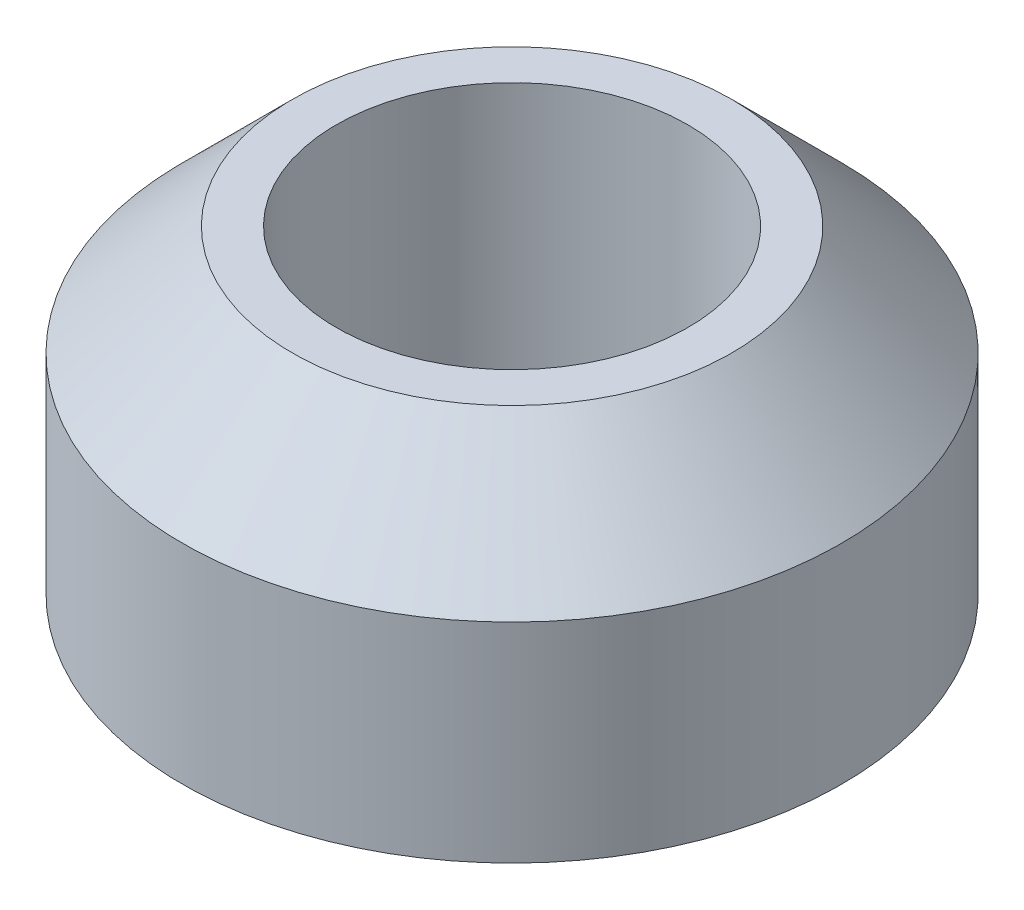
from build123d import *


with BuildPart() as part:
    # Esquisse1 → R_volution1 (revolve)
    with BuildSketch(Plane.XY, mode=Mode.PRIVATE) as r_volution1_sk:
        Polygon((-8, 0), (-15, 0), (-15, 9.5), (-10, 14.5), (-8, 14.5), align=None)
    revolve(r_volution1_sk.sketch.rotate(Axis((0, 0, 0), (0, 1, 0)), 270), axis=Axis((0, 0, 0), (0, 1, 0)))


solid = part.part
